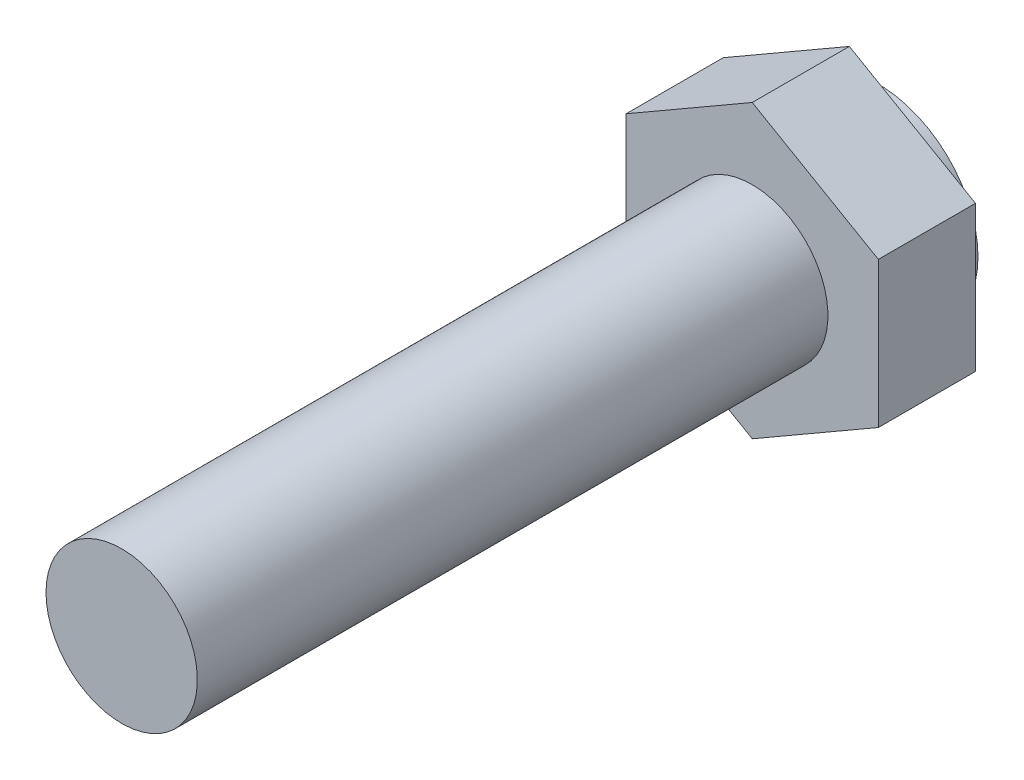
ISO-10303-21;
HEADER;
FILE_DESCRIPTION(('STEP AP214'),'2;1');
FILE_NAME('part.step','',(''),(''),'','','');
FILE_SCHEMA(('AUTOMOTIVE_DESIGN { 1 0 10303 214 1 1 1 1 }'));
ENDSEC;
DATA;
#1=APPLICATION_CONTEXT('core data for automotive mechanical design processes');
#2=APPLICATION_PROTOCOL_DEFINITION('international standard','automotive_design',2000,#1);
#3=PRODUCT_CONTEXT('',#1,'mechanical');
#4=PRODUCT('Part','Part','',(#3));
#5=PRODUCT_RELATED_PRODUCT_CATEGORY('part','',(#4));
#6=PRODUCT_DEFINITION_FORMATION('','',#4);
#7=PRODUCT_DEFINITION_CONTEXT('part definition',#1,'design');
#8=PRODUCT_DEFINITION('design','',#6,#7);
#9=PRODUCT_DEFINITION_SHAPE('','',#8);
#10=(LENGTH_UNIT() NAMED_UNIT(*) SI_UNIT(.MILLI.,.METRE.));
#11=(NAMED_UNIT(*) PLANE_ANGLE_UNIT() SI_UNIT($,.RADIAN.));
#12=(NAMED_UNIT(*) SI_UNIT($,.STERADIAN.) SOLID_ANGLE_UNIT());
#13=UNCERTAINTY_MEASURE_WITH_UNIT(LENGTH_MEASURE(1.E-05),#10,'distance_accuracy_value','');
#14=(GEOMETRIC_REPRESENTATION_CONTEXT(3) GLOBAL_UNCERTAINTY_ASSIGNED_CONTEXT((#13)) GLOBAL_UNIT_ASSIGNED_CONTEXT((#10,
#11,#12)) REPRESENTATION_CONTEXT('',''));
#15=CARTESIAN_POINT('',(0.,0.,0.));
#16=DIRECTION('',(0.,0.,1.));
#17=DIRECTION('',(1.,0.,0.));
#18=AXIS2_PLACEMENT_3D('',#15,#16,#17);
#19=CARTESIAN_POINT('',(0.,0.,30.));
#20=DIRECTION('',(0.,0.,-1.));
#21=DIRECTION('',(-1.,0.,0.));
#22=AXIS2_PLACEMENT_3D('',#19,#20,#21);
#23=PLANE('',#22);
#24=CARTESIAN_POINT('',(0.,0.,30.));
#25=DIRECTION('',(0.,0.,-1.));
#26=DIRECTION('',(-1.,0.,0.));
#27=AXIS2_PLACEMENT_3D('',#24,#25,#26);
#28=CIRCLE('',#27,3.);
#29=CARTESIAN_POINT('',(-3.,0.,30.));
#30=VERTEX_POINT('',#29);
#31=EDGE_CURVE('E22',#30,#30,#28,.T.);
#32=ORIENTED_EDGE('',*,*,#31,.F.);
#33=EDGE_LOOP('',(#32));
#34=FACE_BOUND('',#33,.T.);
#35=ADVANCED_FACE('F15',(#34),#23,.F.);
#36=CARTESIAN_POINT('',(0.,0.,-40.));
#37=DIRECTION('',(0.,0.,-1.));
#38=DIRECTION('',(-1.,0.,0.));
#39=AXIS2_PLACEMENT_3D('',#36,#37,#38);
#40=CYLINDRICAL_SURFACE('',#39,3.);
#41=CARTESIAN_POINT('',(0.,0.,5.));
#42=DIRECTION('',(0.,0.,-1.));
#43=DIRECTION('',(-1.,0.,0.));
#44=AXIS2_PLACEMENT_3D('',#41,#42,#43);
#45=CIRCLE('',#44,3.);
#46=CARTESIAN_POINT('',(-3.,0.,5.));
#47=VERTEX_POINT('',#46);
#48=EDGE_CURVE('E110',#47,#47,#45,.T.);
#49=ORIENTED_EDGE('',*,*,#48,.F.);
#50=EDGE_LOOP('',(#49));
#51=FACE_BOUND('',#50,.T.);
#52=ORIENTED_EDGE('',*,*,#31,.T.);
#53=EDGE_LOOP('',(#52));
#54=FACE_BOUND('',#53,.T.);
#55=ADVANCED_FACE('F154',(#51,#54),#40,.T.);
#56=CARTESIAN_POINT('',(-3.,0.,5.));
#57=DIRECTION('',(0.,0.,-1.));
#58=DIRECTION('',(-1.,0.,0.));
#59=AXIS2_PLACEMENT_3D('',#56,#57,#58);
#60=PLANE('',#59);
#61=DIRECTION('',(0.866025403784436,-0.5,0.));
#62=VECTOR('',#61,1.);
#63=CARTESIAN_POINT('',(0.270322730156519,5.66436512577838,5.));
#64=LINE('',#63,#62);
#65=CARTESIAN_POINT('',(0.,5.82043602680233,5.));
#66=VERTEX_POINT('',#65);
#67=CARTESIAN_POINT('',(5.,2.93368468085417,5.));
#68=VERTEX_POINT('',#67);
#69=EDGE_CURVE('E81',#66,#68,#64,.T.);
#70=ORIENTED_EDGE('',*,*,#69,.F.);
#71=DIRECTION('',(-0.866025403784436,-0.5,0.));
#72=VECTOR('',#71,1.);
#73=CARTESIAN_POINT('',(-4.77032273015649,3.06628891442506,5.));
#74=LINE('',#73,#72);
#75=CARTESIAN_POINT('',(-5.,2.93368468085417,5.));
#76=VERTEX_POINT('',#75);
#77=EDGE_CURVE('E107',#66,#76,#74,.T.);
#78=ORIENTED_EDGE('',*,*,#77,.T.);
#79=DIRECTION('',(0.,-1.,0.));
#80=VECTOR('',#79,1.);
#81=CARTESIAN_POINT('',(-5.,0.,5.));
#82=LINE('',#81,#80);
#83=CARTESIAN_POINT('',(-5.,-2.83981801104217,5.));
#84=VERTEX_POINT('',#83);
#85=EDGE_CURVE('E104',#76,#84,#82,.T.);
#86=ORIENTED_EDGE('',*,*,#85,.T.);
#87=DIRECTION('',(-0.866025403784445,0.49999999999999,0.));
#88=VECTOR('',#87,1.);
#89=CARTESIAN_POINT('',(-4.72967726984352,-2.99588891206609,5.));
#90=LINE('',#89,#88);
#91=CARTESIAN_POINT('',(0.,-5.72656935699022,5.));
#92=VERTEX_POINT('',#91);
#93=EDGE_CURVE('E102',#92,#84,#90,.T.);
#94=ORIENTED_EDGE('',*,*,#93,.F.);
#95=DIRECTION('',(0.866025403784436,0.5,0.));
#96=VECTOR('',#95,1.);
#97=CARTESIAN_POINT('',(0.229677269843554,-5.5939651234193,5.));
#98=LINE('',#97,#96);
#99=CARTESIAN_POINT('',(5.,-2.83981801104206,5.));
#100=VERTEX_POINT('',#99);
#101=EDGE_CURVE('E99',#92,#100,#98,.T.);
#102=ORIENTED_EDGE('',*,*,#101,.T.);
#103=DIRECTION('',(0.,-1.,0.));
#104=VECTOR('',#103,1.);
#105=CARTESIAN_POINT('',(5.,0.,5.));
#106=LINE('',#105,#104);
#107=EDGE_CURVE('E97',#68,#100,#106,.T.);
#108=ORIENTED_EDGE('',*,*,#107,.F.);
#109=EDGE_LOOP('',(#70,#78,#86,#94,#102,#108));
#110=FACE_BOUND('',#109,.T.);
#111=ORIENTED_EDGE('',*,*,#48,.T.);
#112=EDGE_LOOP('',(#111));
#113=FACE_BOUND('',#112,.T.);
#114=ADVANCED_FACE('F136',(#110,#113),#60,.F.);
#115=CARTESIAN_POINT('',(0.,5.82043602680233,10.));
#116=DIRECTION('',(0.5,-0.866025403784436,0.));
#117=DIRECTION('',(-0.866025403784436,-0.5,0.));
#118=AXIS2_PLACEMENT_3D('',#115,#116,#117);
#119=PLANE('',#118);
#120=DIRECTION('',(0.,0.,-1.));
#121=VECTOR('',#120,1.);
#122=CARTESIAN_POINT('',(0.,5.82043602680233,10.));
#123=LINE('',#122,#121);
#124=CARTESIAN_POINT('',(0.,5.82043602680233,1.15));
#125=VERTEX_POINT('',#124);
#126=EDGE_CURVE('E35',#66,#125,#123,.T.);
#127=ORIENTED_EDGE('',*,*,#126,.T.);
#128=DIRECTION('',(-0.866025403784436,-0.5,0.));
#129=VECTOR('',#128,1.);
#130=CARTESIAN_POINT('',(0.,5.82043602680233,1.15));
#131=LINE('',#130,#129);
#132=CARTESIAN_POINT('',(-5.,2.93368468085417,1.15));
#133=VERTEX_POINT('',#132);
#134=EDGE_CURVE('E28',#125,#133,#131,.T.);
#135=ORIENTED_EDGE('',*,*,#134,.T.);
#136=DIRECTION('',(0.,0.,-1.));
#137=VECTOR('',#136,1.);
#138=CARTESIAN_POINT('',(-5.,2.93368468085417,10.));
#139=LINE('',#138,#137);
#140=EDGE_CURVE('E93',#76,#133,#139,.T.);
#141=ORIENTED_EDGE('',*,*,#140,.F.);
#142=ORIENTED_EDGE('',*,*,#77,.F.);
#143=EDGE_LOOP('',(#127,#135,#141,#142));
#144=FACE_BOUND('',#143,.T.);
#145=ADVANCED_FACE('F130',(#144),#119,.F.);
#146=CARTESIAN_POINT('',(-5.,2.93368468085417,10.));
#147=DIRECTION('',(1.,0.,0.));
#148=DIRECTION('',(0.,-1.,0.));
#149=AXIS2_PLACEMENT_3D('',#146,#147,#148);
#150=PLANE('',#149);
#151=ORIENTED_EDGE('',*,*,#140,.T.);
#152=DIRECTION('',(0.,-1.,0.));
#153=VECTOR('',#152,1.);
#154=CARTESIAN_POINT('',(-5.,2.93368468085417,1.15));
#155=LINE('',#154,#153);
#156=CARTESIAN_POINT('',(-5.,-2.83981801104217,1.15));
#157=VERTEX_POINT('',#156);
#158=EDGE_CURVE('E126',#133,#157,#155,.T.);
#159=ORIENTED_EDGE('',*,*,#158,.T.);
#160=DIRECTION('',(0.,0.,-1.));
#161=VECTOR('',#160,1.);
#162=CARTESIAN_POINT('',(-5.,-2.83981801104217,10.));
#163=LINE('',#162,#161);
#164=EDGE_CURVE('E90',#84,#157,#163,.T.);
#165=ORIENTED_EDGE('',*,*,#164,.F.);
#166=ORIENTED_EDGE('',*,*,#85,.F.);
#167=EDGE_LOOP('',(#151,#159,#165,#166));
#168=FACE_BOUND('',#167,.T.);
#169=ADVANCED_FACE('F132',(#168),#150,.F.);
#170=CARTESIAN_POINT('',(0.,-5.72656935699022,10.));
#171=DIRECTION('',(-0.49999999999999,-0.866025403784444,0.));
#172=DIRECTION('',(-0.866025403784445,0.49999999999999,0.));
#173=AXIS2_PLACEMENT_3D('',#170,#171,#172);
#174=PLANE('',#173);
#175=DIRECTION('',(-0.866025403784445,0.49999999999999,0.));
#176=VECTOR('',#175,1.);
#177=CARTESIAN_POINT('',(0.,-5.72656935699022,1.15));
#178=LINE('',#177,#176);
#179=CARTESIAN_POINT('',(0.,-5.72656935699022,1.15));
#180=VERTEX_POINT('',#179);
#181=EDGE_CURVE('E124',#180,#157,#178,.T.);
#182=ORIENTED_EDGE('',*,*,#181,.F.);
#183=DIRECTION('',(0.,0.,-1.));
#184=VECTOR('',#183,1.);
#185=CARTESIAN_POINT('',(0.,-5.72656935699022,10.));
#186=LINE('',#185,#184);
#187=EDGE_CURVE('E83',#92,#180,#186,.T.);
#188=ORIENTED_EDGE('',*,*,#187,.F.);
#189=ORIENTED_EDGE('',*,*,#93,.T.);
#190=ORIENTED_EDGE('',*,*,#164,.T.);
#191=EDGE_LOOP('',(#182,#188,#189,#190));
#192=FACE_BOUND('',#191,.T.);
#193=ADVANCED_FACE('F143',(#192),#174,.T.);
#194=CARTESIAN_POINT('',(0.,-5.72656935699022,10.));
#195=DIRECTION('',(-0.5,0.866025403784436,0.));
#196=DIRECTION('',(0.866025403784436,0.5,0.));
#197=AXIS2_PLACEMENT_3D('',#194,#195,#196);
#198=PLANE('',#197);
#199=ORIENTED_EDGE('',*,*,#187,.T.);
#200=DIRECTION('',(0.866025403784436,0.5,0.));
#201=VECTOR('',#200,1.);
#202=CARTESIAN_POINT('',(0.,-5.72656935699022,1.15));
#203=LINE('',#202,#201);
#204=CARTESIAN_POINT('',(5.,-2.83981801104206,1.15));
#205=VERTEX_POINT('',#204);
#206=EDGE_CURVE('E76',#180,#205,#203,.T.);
#207=ORIENTED_EDGE('',*,*,#206,.T.);
#208=DIRECTION('',(0.,0.,-1.));
#209=VECTOR('',#208,1.);
#210=CARTESIAN_POINT('',(5.,-2.83981801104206,10.));
#211=LINE('',#210,#209);
#212=EDGE_CURVE('E75',#100,#205,#211,.T.);
#213=ORIENTED_EDGE('',*,*,#212,.F.);
#214=ORIENTED_EDGE('',*,*,#101,.F.);
#215=EDGE_LOOP('',(#199,#207,#213,#214));
#216=FACE_BOUND('',#215,.T.);
#217=ADVANCED_FACE('F139',(#216),#198,.F.);
#218=CARTESIAN_POINT('',(5.,2.93368468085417,10.));
#219=DIRECTION('',(1.,0.,0.));
#220=DIRECTION('',(0.,-1.,0.));
#221=AXIS2_PLACEMENT_3D('',#218,#219,#220);
#222=PLANE('',#221);
#223=DIRECTION('',(0.,-1.,0.));
#224=VECTOR('',#223,1.);
#225=CARTESIAN_POINT('',(5.,2.93368468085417,1.15));
#226=LINE('',#225,#224);
#227=CARTESIAN_POINT('',(5.,2.93368468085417,1.15));
#228=VERTEX_POINT('',#227);
#229=EDGE_CURVE('E65',#228,#205,#226,.T.);
#230=ORIENTED_EDGE('',*,*,#229,.F.);
#231=DIRECTION('',(0.,0.,-1.));
#232=VECTOR('',#231,1.);
#233=CARTESIAN_POINT('',(5.,2.93368468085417,10.));
#234=LINE('',#233,#232);
#235=EDGE_CURVE('E72',#68,#228,#234,.T.);
#236=ORIENTED_EDGE('',*,*,#235,.F.);
#237=ORIENTED_EDGE('',*,*,#107,.T.);
#238=ORIENTED_EDGE('',*,*,#212,.T.);
#239=EDGE_LOOP('',(#230,#236,#237,#238));
#240=FACE_BOUND('',#239,.T.);
#241=ADVANCED_FACE('F71',(#240),#222,.T.);
#242=CARTESIAN_POINT('',(0.,5.82043602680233,10.));
#243=DIRECTION('',(0.5,0.866025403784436,0.));
#244=DIRECTION('',(0.866025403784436,-0.5,0.));
#245=AXIS2_PLACEMENT_3D('',#242,#243,#244);
#246=PLANE('',#245);
#247=DIRECTION('',(0.866025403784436,-0.5,0.));
#248=VECTOR('',#247,1.);
#249=CARTESIAN_POINT('',(0.,5.82043602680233,1.15));
#250=LINE('',#249,#248);
#251=EDGE_CURVE('E9',#125,#228,#250,.T.);
#252=ORIENTED_EDGE('',*,*,#251,.F.);
#253=ORIENTED_EDGE('',*,*,#126,.F.);
#254=ORIENTED_EDGE('',*,*,#69,.T.);
#255=ORIENTED_EDGE('',*,*,#235,.T.);
#256=EDGE_LOOP('',(#252,#253,#254,#255));
#257=FACE_BOUND('',#256,.T.);
#258=ADVANCED_FACE('F79',(#257),#246,.T.);
#259=CARTESIAN_POINT('',(0.,10.,1.15));
#260=DIRECTION('',(0.,0.,1.));
#261=DIRECTION('',(1.,0.,0.));
#262=AXIS2_PLACEMENT_3D('',#259,#260,#261);
#263=PLANE('',#262);
#264=CARTESIAN_POINT('',(0.,0.,1.15));
#265=DIRECTION('',(0.,0.,-1.));
#266=DIRECTION('',(-1.,0.,0.));
#267=AXIS2_PLACEMENT_3D('',#264,#265,#266);
#268=CIRCLE('',#267,3.95);
#269=CARTESIAN_POINT('',(-3.95,0.,1.15));
#270=VERTEX_POINT('',#269);
#271=EDGE_CURVE('E115',#270,#270,#268,.T.);
#272=ORIENTED_EDGE('',*,*,#271,.F.);
#273=EDGE_LOOP('',(#272));
#274=FACE_BOUND('',#273,.T.);
#275=ORIENTED_EDGE('',*,*,#251,.T.);
#276=ORIENTED_EDGE('',*,*,#229,.T.);
#277=ORIENTED_EDGE('',*,*,#206,.F.);
#278=ORIENTED_EDGE('',*,*,#181,.T.);
#279=ORIENTED_EDGE('',*,*,#158,.F.);
#280=ORIENTED_EDGE('',*,*,#134,.F.);
#281=EDGE_LOOP('',(#275,#276,#277,#278,#279,#280));
#282=FACE_BOUND('',#281,.T.);
#283=ADVANCED_FACE('F64',(#274,#282),#263,.F.);
#284=CARTESIAN_POINT('',(0.,0.,-10.));
#285=DIRECTION('',(0.,0.,-1.));
#286=DIRECTION('',(-1.,0.,0.));
#287=AXIS2_PLACEMENT_3D('',#284,#285,#286);
#288=CYLINDRICAL_SURFACE('',#287,3.95);
#289=ORIENTED_EDGE('',*,*,#271,.T.);
#290=EDGE_LOOP('',(#289));
#291=FACE_BOUND('',#290,.T.);
#292=CARTESIAN_POINT('',(0.,0.,0.));
#293=DIRECTION('',(0.,0.,1.));
#294=DIRECTION('',(1.,0.,0.));
#295=AXIS2_PLACEMENT_3D('',#292,#293,#294);
#296=CIRCLE('',#295,3.95);
#297=CARTESIAN_POINT('',(3.95,0.,0.));
#298=VERTEX_POINT('',#297);
#299=EDGE_CURVE('E77',#298,#298,#296,.T.);
#300=ORIENTED_EDGE('',*,*,#299,.T.);
#301=EDGE_LOOP('',(#300));
#302=FACE_BOUND('',#301,.T.);
#303=ADVANCED_FACE('F170',(#291,#302),#288,.T.);
#304=CARTESIAN_POINT('',(-6.,0.,0.));
#305=DIRECTION('',(0.,0.,1.));
#306=DIRECTION('',(1.,0.,0.));
#307=AXIS2_PLACEMENT_3D('',#304,#305,#306);
#308=PLANE('',#307);
#309=ORIENTED_EDGE('',*,*,#299,.F.);
#310=EDGE_LOOP('',(#309));
#311=FACE_BOUND('',#310,.T.);
#312=ADVANCED_FACE('F168',(#311),#308,.F.);
#313=CLOSED_SHELL('',(#35,#55,#114,#145,#169,#193,#217,#241,#258,#283,#303,#312));
#314=MANIFOLD_SOLID_BREP('B1',#313);
#315=ADVANCED_BREP_SHAPE_REPRESENTATION('',(#18,#314),#14);
#316=SHAPE_DEFINITION_REPRESENTATION(#9,#315);
ENDSEC;
END-ISO-10303-21;
